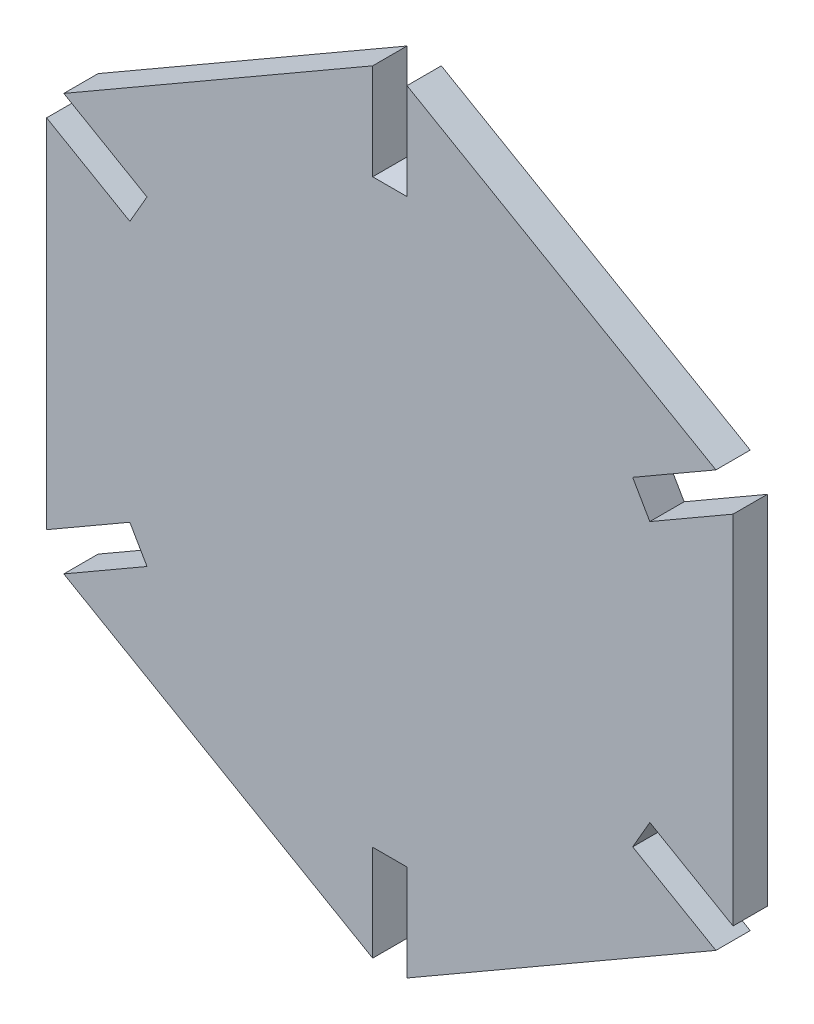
ISO-10303-21;
HEADER;
FILE_DESCRIPTION(('STEP AP214'),'2;1');
FILE_NAME('part.step','',(''),(''),'','','');
FILE_SCHEMA(('AUTOMOTIVE_DESIGN { 1 0 10303 214 1 1 1 1 }'));
ENDSEC;
DATA;
#1=APPLICATION_CONTEXT('core data for automotive mechanical design processes');
#2=APPLICATION_PROTOCOL_DEFINITION('international standard','automotive_design',2000,#1);
#3=PRODUCT_CONTEXT('',#1,'mechanical');
#4=PRODUCT('Part','Part','',(#3));
#5=PRODUCT_RELATED_PRODUCT_CATEGORY('part','',(#4));
#6=PRODUCT_DEFINITION_FORMATION('','',#4);
#7=PRODUCT_DEFINITION_CONTEXT('part definition',#1,'design');
#8=PRODUCT_DEFINITION('design','',#6,#7);
#9=PRODUCT_DEFINITION_SHAPE('','',#8);
#10=(LENGTH_UNIT() NAMED_UNIT(*) SI_UNIT(.MILLI.,.METRE.));
#11=(NAMED_UNIT(*) PLANE_ANGLE_UNIT() SI_UNIT($,.RADIAN.));
#12=(NAMED_UNIT(*) SI_UNIT($,.STERADIAN.) SOLID_ANGLE_UNIT());
#13=UNCERTAINTY_MEASURE_WITH_UNIT(LENGTH_MEASURE(1.E-05),#10,'distance_accuracy_value','');
#14=(GEOMETRIC_REPRESENTATION_CONTEXT(3) GLOBAL_UNCERTAINTY_ASSIGNED_CONTEXT((#13)) GLOBAL_UNIT_ASSIGNED_CONTEXT((#10,
#11,#12)) REPRESENTATION_CONTEXT('',''));
#15=CARTESIAN_POINT('',(0.,0.,0.));
#16=DIRECTION('',(0.,0.,1.));
#17=DIRECTION('',(1.,0.,0.));
#18=AXIS2_PLACEMENT_3D('',#15,#16,#17);
#19=CARTESIAN_POINT('',(0.,28.8675134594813,2.5));
#20=DIRECTION('',(0.5,-0.866025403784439,0.));
#21=DIRECTION('',(0.866025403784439,0.5,0.));
#22=AXIS2_PLACEMENT_3D('',#19,#20,#21);
#23=PLANE('',#22);
#24=DIRECTION('',(-0.866025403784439,-0.5,0.));
#25=VECTOR('',#24,1.);
#26=CARTESIAN_POINT('',(0.,28.8675134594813,0.));
#27=LINE('',#26,#25);
#28=CARTESIAN_POINT('',(-1.24999999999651,28.1458256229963,0.));
#29=VERTEX_POINT('',#28);
#30=CARTESIAN_POINT('',(-23.7499999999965,15.1554445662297,0.));
#31=VERTEX_POINT('',#30);
#32=EDGE_CURVE('E373',#29,#31,#27,.T.);
#33=ORIENTED_EDGE('',*,*,#32,.T.);
#34=DIRECTION('',(0.,0.,1.));
#35=VECTOR('',#34,1.);
#36=CARTESIAN_POINT('',(-23.7499999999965,15.1554445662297,0.));
#37=LINE('',#36,#35);
#38=CARTESIAN_POINT('',(-23.7499999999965,15.1554445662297,2.5));
#39=VERTEX_POINT('',#38);
#40=EDGE_CURVE('E329',#31,#39,#37,.T.);
#41=ORIENTED_EDGE('',*,*,#40,.T.);
#42=DIRECTION('',(-0.866025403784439,-0.5,0.));
#43=VECTOR('',#42,1.);
#44=CARTESIAN_POINT('',(0.,28.8675134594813,2.5));
#45=LINE('',#44,#43);
#46=CARTESIAN_POINT('',(-1.24999999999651,28.1458256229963,2.5));
#47=VERTEX_POINT('',#46);
#48=EDGE_CURVE('E361',#47,#39,#45,.T.);
#49=ORIENTED_EDGE('',*,*,#48,.F.);
#50=DIRECTION('',(0.,0.,1.));
#51=VECTOR('',#50,1.);
#52=CARTESIAN_POINT('',(-1.24999999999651,28.1458256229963,0.));
#53=LINE('',#52,#51);
#54=EDGE_CURVE('E353',#29,#47,#53,.T.);
#55=ORIENTED_EDGE('',*,*,#54,.F.);
#56=EDGE_LOOP('',(#33,#41,#49,#55));
#57=FACE_BOUND('',#56,.T.);
#58=ADVANCED_FACE('F33',(#57),#23,.F.);
#59=CARTESIAN_POINT('',(0.,0.,2.5));
#60=DIRECTION('',(0.,0.,1.));
#61=DIRECTION('',(1.,0.,0.));
#62=AXIS2_PLACEMENT_3D('',#59,#60,#61);
#63=PLANE('',#62);
#64=DIRECTION('',(-0.866025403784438,-0.5,0.));
#65=VECTOR('',#64,1.);
#66=CARTESIAN_POINT('',(17.6878221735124,11.6554445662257,2.5));
#67=LINE('',#66,#65);
#68=CARTESIAN_POINT('',(23.7500000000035,15.1554445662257,2.5));
#69=VERTEX_POINT('',#68);
#70=CARTESIAN_POINT('',(17.6878221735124,11.6554445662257,2.5));
#71=VERTEX_POINT('',#70);
#72=EDGE_CURVE('E202',#69,#71,#67,.T.);
#73=ORIENTED_EDGE('',*,*,#72,.F.);
#74=DIRECTION('',(-0.866025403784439,0.5,0.));
#75=VECTOR('',#74,1.);
#76=CARTESIAN_POINT('',(25.,14.4337567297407,2.5));
#77=LINE('',#76,#75);
#78=CARTESIAN_POINT('',(1.25000000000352,28.1458256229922,2.5));
#79=VERTEX_POINT('',#78);
#80=EDGE_CURVE('E359',#69,#79,#77,.T.);
#81=ORIENTED_EDGE('',*,*,#80,.T.);
#82=DIRECTION('',(0.,1.,0.));
#83=VECTOR('',#82,1.);
#84=CARTESIAN_POINT('',(1.25000000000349,21.1458256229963,2.5));
#85=LINE('',#84,#83);
#86=CARTESIAN_POINT('',(1.25000000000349,21.1458256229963,2.5));
#87=VERTEX_POINT('',#86);
#88=EDGE_CURVE('E346',#87,#79,#85,.T.);
#89=ORIENTED_EDGE('',*,*,#88,.F.);
#90=DIRECTION('',(1.,0.,0.));
#91=VECTOR('',#90,1.);
#92=CARTESIAN_POINT('',(-1.24999999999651,21.1458256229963,2.5));
#93=LINE('',#92,#91);
#94=CARTESIAN_POINT('',(-1.24999999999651,21.1458256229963,2.5));
#95=VERTEX_POINT('',#94);
#96=EDGE_CURVE('E231',#95,#87,#93,.T.);
#97=ORIENTED_EDGE('',*,*,#96,.F.);
#98=DIRECTION('',(0.,1.,0.));
#99=VECTOR('',#98,1.);
#100=CARTESIAN_POINT('',(-1.24999999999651,21.1458256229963,2.5));
#101=LINE('',#100,#99);
#102=EDGE_CURVE('E339',#95,#47,#101,.T.);
#103=ORIENTED_EDGE('',*,*,#102,.T.);
#104=ORIENTED_EDGE('',*,*,#48,.T.);
#105=DIRECTION('',(-0.866025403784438,0.500000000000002,0.));
#106=VECTOR('',#105,1.);
#107=CARTESIAN_POINT('',(-17.6878221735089,11.6554445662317,2.5));
#108=LINE('',#107,#106);
#109=CARTESIAN_POINT('',(-17.6878221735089,11.6554445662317,2.5));
#110=VERTEX_POINT('',#109);
#111=EDGE_CURVE('E314',#110,#39,#108,.T.);
#112=ORIENTED_EDGE('',*,*,#111,.F.);
#113=DIRECTION('',(0.499999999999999,0.866025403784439,0.));
#114=VECTOR('',#113,1.);
#115=CARTESIAN_POINT('',(-18.9378221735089,9.49038105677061,2.5));
#116=LINE('',#115,#114);
#117=CARTESIAN_POINT('',(-18.9378221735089,9.49038105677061,2.5));
#118=VERTEX_POINT('',#117);
#119=EDGE_CURVE('E324',#118,#110,#116,.T.);
#120=ORIENTED_EDGE('',*,*,#119,.F.);
#121=DIRECTION('',(0.866025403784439,-0.499999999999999,0.));
#122=VECTOR('',#121,1.);
#123=CARTESIAN_POINT('',(-18.9378221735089,9.49038105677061,2.5));
#124=LINE('',#123,#122);
#125=CARTESIAN_POINT('',(-25.,12.9903810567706,2.5));
#126=VERTEX_POINT('',#125);
#127=EDGE_CURVE('E321',#126,#118,#124,.T.);
#128=ORIENTED_EDGE('',*,*,#127,.F.);
#129=DIRECTION('',(0.,-1.,0.));
#130=VECTOR('',#129,1.);
#131=CARTESIAN_POINT('',(-25.,14.4337567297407,2.5));
#132=LINE('',#131,#130);
#133=CARTESIAN_POINT('',(-25.,-12.9903810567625,2.5));
#134=VERTEX_POINT('',#133);
#135=EDGE_CURVE('E364',#126,#134,#132,.T.);
#136=ORIENTED_EDGE('',*,*,#135,.T.);
#137=DIRECTION('',(-0.86602540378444,-0.499999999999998,0.));
#138=VECTOR('',#137,1.);
#139=CARTESIAN_POINT('',(-18.9378221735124,-9.49038105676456,2.5));
#140=LINE('',#139,#138);
#141=CARTESIAN_POINT('',(-18.9378221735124,-9.49038105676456,2.5));
#142=VERTEX_POINT('',#141);
#143=EDGE_CURVE('E290',#142,#134,#140,.T.);
#144=ORIENTED_EDGE('',*,*,#143,.F.);
#145=DIRECTION('',(-0.5,0.866025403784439,0.));
#146=VECTOR('',#145,1.);
#147=CARTESIAN_POINT('',(-17.6878221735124,-11.6554445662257,2.5));
#148=LINE('',#147,#146);
#149=CARTESIAN_POINT('',(-17.6878221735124,-11.6554445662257,2.5));
#150=VERTEX_POINT('',#149);
#151=EDGE_CURVE('E300',#150,#142,#148,.T.);
#152=ORIENTED_EDGE('',*,*,#151,.F.);
#153=DIRECTION('',(0.866025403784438,0.5,0.));
#154=VECTOR('',#153,1.);
#155=CARTESIAN_POINT('',(-17.6878221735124,-11.6554445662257,2.5));
#156=LINE('',#155,#154);
#157=CARTESIAN_POINT('',(-23.7500000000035,-15.1554445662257,2.5));
#158=VERTEX_POINT('',#157);
#159=EDGE_CURVE('E297',#158,#150,#156,.T.);
#160=ORIENTED_EDGE('',*,*,#159,.F.);
#161=DIRECTION('',(0.866025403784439,-0.5,0.));
#162=VECTOR('',#161,1.);
#163=CARTESIAN_POINT('',(-25.,-14.4337567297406,2.5));
#164=LINE('',#163,#162);
#165=CARTESIAN_POINT('',(-1.25000000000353,-28.1458256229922,2.5));
#166=VERTEX_POINT('',#165);
#167=EDGE_CURVE('E367',#158,#166,#164,.T.);
#168=ORIENTED_EDGE('',*,*,#167,.T.);
#169=DIRECTION('',(0.,-1.,0.));
#170=VECTOR('',#169,1.);
#171=CARTESIAN_POINT('',(-1.2500000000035,-21.1458256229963,2.5));
#172=LINE('',#171,#170);
#173=CARTESIAN_POINT('',(-1.2500000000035,-21.1458256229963,2.5));
#174=VERTEX_POINT('',#173);
#175=EDGE_CURVE('E266',#174,#166,#172,.T.);
#176=ORIENTED_EDGE('',*,*,#175,.F.);
#177=DIRECTION('',(-1.,0.,0.));
#178=VECTOR('',#177,1.);
#179=CARTESIAN_POINT('',(1.2499999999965,-21.1458256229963,2.5));
#180=LINE('',#179,#178);
#181=CARTESIAN_POINT('',(1.2499999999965,-21.1458256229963,2.5));
#182=VERTEX_POINT('',#181);
#183=EDGE_CURVE('E276',#182,#174,#180,.T.);
#184=ORIENTED_EDGE('',*,*,#183,.F.);
#185=DIRECTION('',(0.,1.,0.));
#186=VECTOR('',#185,1.);
#187=CARTESIAN_POINT('',(1.2499999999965,-21.1458256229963,2.5));
#188=LINE('',#187,#186);
#189=CARTESIAN_POINT('',(1.2499999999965,-28.1458256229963,2.5));
#190=VERTEX_POINT('',#189);
#191=EDGE_CURVE('E273',#190,#182,#188,.T.);
#192=ORIENTED_EDGE('',*,*,#191,.F.);
#193=DIRECTION('',(0.866025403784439,0.499999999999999,0.));
#194=VECTOR('',#193,1.);
#195=CARTESIAN_POINT('',(0.,-28.8675134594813,2.5));
#196=LINE('',#195,#194);
#197=CARTESIAN_POINT('',(23.7499999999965,-15.1554445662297,2.5));
#198=VERTEX_POINT('',#197);
#199=EDGE_CURVE('E42',#190,#198,#196,.T.);
#200=ORIENTED_EDGE('',*,*,#199,.T.);
#201=DIRECTION('',(0.866025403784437,-0.500000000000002,0.));
#202=VECTOR('',#201,1.);
#203=CARTESIAN_POINT('',(17.6878221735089,-11.6554445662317,2.5));
#204=LINE('',#203,#202);
#205=CARTESIAN_POINT('',(17.6878221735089,-11.6554445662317,2.5));
#206=VERTEX_POINT('',#205);
#207=EDGE_CURVE('E240',#206,#198,#204,.T.);
#208=ORIENTED_EDGE('',*,*,#207,.F.);
#209=DIRECTION('',(-0.5,-0.866025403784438,0.));
#210=VECTOR('',#209,1.);
#211=CARTESIAN_POINT('',(18.9378221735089,-9.4903810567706,2.5));
#212=LINE('',#211,#210);
#213=CARTESIAN_POINT('',(18.9378221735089,-9.4903810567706,2.5));
#214=VERTEX_POINT('',#213);
#215=EDGE_CURVE('E250',#214,#206,#212,.T.);
#216=ORIENTED_EDGE('',*,*,#215,.F.);
#217=DIRECTION('',(-0.866025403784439,0.499999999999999,0.));
#218=VECTOR('',#217,1.);
#219=CARTESIAN_POINT('',(18.9378221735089,-9.4903810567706,2.5));
#220=LINE('',#219,#218);
#221=CARTESIAN_POINT('',(25.,-12.9903810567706,2.5));
#222=VERTEX_POINT('',#221);
#223=EDGE_CURVE('E247',#222,#214,#220,.T.);
#224=ORIENTED_EDGE('',*,*,#223,.F.);
#225=DIRECTION('',(0.,1.,0.));
#226=VECTOR('',#225,1.);
#227=CARTESIAN_POINT('',(25.,-14.4337567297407,2.5));
#228=LINE('',#227,#226);
#229=CARTESIAN_POINT('',(25.,12.9903810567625,2.5));
#230=VERTEX_POINT('',#229);
#231=EDGE_CURVE('E11',#222,#230,#228,.T.);
#232=ORIENTED_EDGE('',*,*,#231,.T.);
#233=DIRECTION('',(0.86602540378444,0.499999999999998,0.));
#234=VECTOR('',#233,1.);
#235=CARTESIAN_POINT('',(18.9378221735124,9.49038105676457,2.5));
#236=LINE('',#235,#234);
#237=CARTESIAN_POINT('',(18.9378221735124,9.49038105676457,2.5));
#238=VERTEX_POINT('',#237);
#239=EDGE_CURVE('E220',#238,#230,#236,.T.);
#240=ORIENTED_EDGE('',*,*,#239,.F.);
#241=DIRECTION('',(0.500000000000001,-0.866025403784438,0.));
#242=VECTOR('',#241,1.);
#243=CARTESIAN_POINT('',(17.6878221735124,11.6554445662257,2.5));
#244=LINE('',#243,#242);
#245=EDGE_CURVE('E222',#71,#238,#244,.T.);
#246=ORIENTED_EDGE('',*,*,#245,.F.);
#247=EDGE_LOOP('',(#73,#81,#89,#97,#103,#104,#112,#120,#128,#136,#144,#152,#160,#168,#176,#184,
#192,#200,#208,#216,#224,#232,#240,#246));
#248=FACE_BOUND('',#247,.T.);
#249=ADVANCED_FACE('F396',(#248),#63,.T.);
#250=CARTESIAN_POINT('',(0.,0.,0.));
#251=DIRECTION('',(0.,0.,1.));
#252=DIRECTION('',(1.,0.,0.));
#253=AXIS2_PLACEMENT_3D('',#250,#251,#252);
#254=PLANE('',#253);
#255=DIRECTION('',(-0.866025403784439,0.5,0.));
#256=VECTOR('',#255,1.);
#257=CARTESIAN_POINT('',(25.,14.4337567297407,0.));
#258=LINE('',#257,#256);
#259=CARTESIAN_POINT('',(23.7500000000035,15.1554445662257,0.));
#260=VERTEX_POINT('',#259);
#261=CARTESIAN_POINT('',(1.25000000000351,28.1458256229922,0.));
#262=VERTEX_POINT('',#261);
#263=EDGE_CURVE('E219',#260,#262,#258,.T.);
#264=ORIENTED_EDGE('',*,*,#263,.F.);
#265=DIRECTION('',(-0.866025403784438,-0.5,0.));
#266=VECTOR('',#265,1.);
#267=CARTESIAN_POINT('',(17.6878221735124,11.6554445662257,0.));
#268=LINE('',#267,#266);
#269=CARTESIAN_POINT('',(17.6878221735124,11.6554445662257,0.));
#270=VERTEX_POINT('',#269);
#271=EDGE_CURVE('E199',#260,#270,#268,.T.);
#272=ORIENTED_EDGE('',*,*,#271,.T.);
#273=DIRECTION('',(0.500000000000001,-0.866025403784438,0.));
#274=VECTOR('',#273,1.);
#275=CARTESIAN_POINT('',(17.6878221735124,11.6554445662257,0.));
#276=LINE('',#275,#274);
#277=CARTESIAN_POINT('',(18.9378221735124,9.49038105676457,0.));
#278=VERTEX_POINT('',#277);
#279=EDGE_CURVE('E210',#270,#278,#276,.T.);
#280=ORIENTED_EDGE('',*,*,#279,.T.);
#281=DIRECTION('',(0.86602540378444,0.499999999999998,0.));
#282=VECTOR('',#281,1.);
#283=CARTESIAN_POINT('',(18.9378221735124,9.49038105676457,0.));
#284=LINE('',#283,#282);
#285=CARTESIAN_POINT('',(25.,12.9903810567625,0.));
#286=VERTEX_POINT('',#285);
#287=EDGE_CURVE('E207',#278,#286,#284,.T.);
#288=ORIENTED_EDGE('',*,*,#287,.T.);
#289=DIRECTION('',(0.,1.,0.));
#290=VECTOR('',#289,1.);
#291=CARTESIAN_POINT('',(25.,-14.4337567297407,0.));
#292=LINE('',#291,#290);
#293=CARTESIAN_POINT('',(25.,-12.9903810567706,0.));
#294=VERTEX_POINT('',#293);
#295=EDGE_CURVE('E37',#294,#286,#292,.T.);
#296=ORIENTED_EDGE('',*,*,#295,.F.);
#297=DIRECTION('',(-0.866025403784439,0.499999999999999,0.));
#298=VECTOR('',#297,1.);
#299=CARTESIAN_POINT('',(18.9378221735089,-9.4903810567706,0.));
#300=LINE('',#299,#298);
#301=CARTESIAN_POINT('',(18.9378221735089,-9.4903810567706,0.));
#302=VERTEX_POINT('',#301);
#303=EDGE_CURVE('E236',#294,#302,#300,.T.);
#304=ORIENTED_EDGE('',*,*,#303,.T.);
#305=DIRECTION('',(-0.5,-0.866025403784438,0.));
#306=VECTOR('',#305,1.);
#307=CARTESIAN_POINT('',(18.9378221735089,-9.4903810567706,0.));
#308=LINE('',#307,#306);
#309=CARTESIAN_POINT('',(17.6878221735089,-11.6554445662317,0.));
#310=VERTEX_POINT('',#309);
#311=EDGE_CURVE('E239',#302,#310,#308,.T.);
#312=ORIENTED_EDGE('',*,*,#311,.T.);
#313=DIRECTION('',(0.866025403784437,-0.500000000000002,0.));
#314=VECTOR('',#313,1.);
#315=CARTESIAN_POINT('',(17.6878221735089,-11.6554445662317,0.));
#316=LINE('',#315,#314);
#317=CARTESIAN_POINT('',(23.7499999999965,-15.1554445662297,0.));
#318=VERTEX_POINT('',#317);
#319=EDGE_CURVE('E243',#310,#318,#316,.T.);
#320=ORIENTED_EDGE('',*,*,#319,.T.);
#321=DIRECTION('',(0.866025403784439,0.499999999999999,0.));
#322=VECTOR('',#321,1.);
#323=CARTESIAN_POINT('',(0.,-28.8675134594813,0.));
#324=LINE('',#323,#322);
#325=CARTESIAN_POINT('',(1.2499999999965,-28.1458256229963,0.));
#326=VERTEX_POINT('',#325);
#327=EDGE_CURVE('E381',#326,#318,#324,.T.);
#328=ORIENTED_EDGE('',*,*,#327,.F.);
#329=DIRECTION('',(0.,1.,0.));
#330=VECTOR('',#329,1.);
#331=CARTESIAN_POINT('',(1.2499999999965,-21.1458256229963,0.));
#332=LINE('',#331,#330);
#333=CARTESIAN_POINT('',(1.2499999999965,-21.1458256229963,0.));
#334=VERTEX_POINT('',#333);
#335=EDGE_CURVE('E262',#326,#334,#332,.T.);
#336=ORIENTED_EDGE('',*,*,#335,.T.);
#337=DIRECTION('',(-1.,0.,0.));
#338=VECTOR('',#337,1.);
#339=CARTESIAN_POINT('',(1.2499999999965,-21.1458256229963,0.));
#340=LINE('',#339,#338);
#341=CARTESIAN_POINT('',(-1.2500000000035,-21.1458256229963,0.));
#342=VERTEX_POINT('',#341);
#343=EDGE_CURVE('E265',#334,#342,#340,.T.);
#344=ORIENTED_EDGE('',*,*,#343,.T.);
#345=DIRECTION('',(0.,-1.,0.));
#346=VECTOR('',#345,1.);
#347=CARTESIAN_POINT('',(-1.2500000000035,-21.1458256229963,0.));
#348=LINE('',#347,#346);
#349=CARTESIAN_POINT('',(-1.25000000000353,-28.1458256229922,0.));
#350=VERTEX_POINT('',#349);
#351=EDGE_CURVE('E269',#342,#350,#348,.T.);
#352=ORIENTED_EDGE('',*,*,#351,.T.);
#353=DIRECTION('',(0.866025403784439,-0.5,0.));
#354=VECTOR('',#353,1.);
#355=CARTESIAN_POINT('',(-25.,-14.4337567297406,0.));
#356=LINE('',#355,#354);
#357=CARTESIAN_POINT('',(-23.7500000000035,-15.1554445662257,0.));
#358=VERTEX_POINT('',#357);
#359=EDGE_CURVE('E379',#358,#350,#356,.T.);
#360=ORIENTED_EDGE('',*,*,#359,.F.);
#361=DIRECTION('',(0.866025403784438,0.5,0.));
#362=VECTOR('',#361,1.);
#363=CARTESIAN_POINT('',(-17.6878221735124,-11.6554445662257,0.));
#364=LINE('',#363,#362);
#365=CARTESIAN_POINT('',(-17.6878221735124,-11.6554445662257,0.));
#366=VERTEX_POINT('',#365);
#367=EDGE_CURVE('E58',#358,#366,#364,.T.);
#368=ORIENTED_EDGE('',*,*,#367,.T.);
#369=DIRECTION('',(-0.5,0.866025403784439,0.));
#370=VECTOR('',#369,1.);
#371=CARTESIAN_POINT('',(-17.6878221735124,-11.6554445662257,0.));
#372=LINE('',#371,#370);
#373=CARTESIAN_POINT('',(-18.9378221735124,-9.49038105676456,0.));
#374=VERTEX_POINT('',#373);
#375=EDGE_CURVE('E289',#366,#374,#372,.T.);
#376=ORIENTED_EDGE('',*,*,#375,.T.);
#377=DIRECTION('',(-0.86602540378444,-0.499999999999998,0.));
#378=VECTOR('',#377,1.);
#379=CARTESIAN_POINT('',(-18.9378221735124,-9.49038105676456,0.));
#380=LINE('',#379,#378);
#381=CARTESIAN_POINT('',(-25.,-12.9903810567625,0.));
#382=VERTEX_POINT('',#381);
#383=EDGE_CURVE('E293',#374,#382,#380,.T.);
#384=ORIENTED_EDGE('',*,*,#383,.T.);
#385=DIRECTION('',(0.,-1.,0.));
#386=VECTOR('',#385,1.);
#387=CARTESIAN_POINT('',(-25.,14.4337567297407,0.));
#388=LINE('',#387,#386);
#389=CARTESIAN_POINT('',(-25.,12.9903810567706,0.));
#390=VERTEX_POINT('',#389);
#391=EDGE_CURVE('E376',#390,#382,#388,.T.);
#392=ORIENTED_EDGE('',*,*,#391,.F.);
#393=DIRECTION('',(0.866025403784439,-0.499999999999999,0.));
#394=VECTOR('',#393,1.);
#395=CARTESIAN_POINT('',(-18.9378221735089,9.49038105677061,0.));
#396=LINE('',#395,#394);
#397=CARTESIAN_POINT('',(-18.9378221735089,9.49038105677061,0.));
#398=VERTEX_POINT('',#397);
#399=EDGE_CURVE('E50',#390,#398,#396,.T.);
#400=ORIENTED_EDGE('',*,*,#399,.T.);
#401=DIRECTION('',(0.499999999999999,0.866025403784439,0.));
#402=VECTOR('',#401,1.);
#403=CARTESIAN_POINT('',(-18.9378221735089,9.49038105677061,0.));
#404=LINE('',#403,#402);
#405=CARTESIAN_POINT('',(-17.6878221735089,11.6554445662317,0.));
#406=VERTEX_POINT('',#405);
#407=EDGE_CURVE('E313',#398,#406,#404,.T.);
#408=ORIENTED_EDGE('',*,*,#407,.T.);
#409=DIRECTION('',(-0.866025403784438,0.500000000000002,0.));
#410=VECTOR('',#409,1.);
#411=CARTESIAN_POINT('',(-17.6878221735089,11.6554445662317,0.));
#412=LINE('',#411,#410);
#413=EDGE_CURVE('E317',#406,#31,#412,.T.);
#414=ORIENTED_EDGE('',*,*,#413,.T.);
#415=ORIENTED_EDGE('',*,*,#32,.F.);
#416=DIRECTION('',(0.,1.,0.));
#417=VECTOR('',#416,1.);
#418=CARTESIAN_POINT('',(-1.24999999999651,21.1458256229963,0.));
#419=LINE('',#418,#417);
#420=CARTESIAN_POINT('',(-1.24999999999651,21.1458256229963,0.));
#421=VERTEX_POINT('',#420);
#422=EDGE_CURVE('E341',#421,#29,#419,.T.);
#423=ORIENTED_EDGE('',*,*,#422,.F.);
#424=DIRECTION('',(1.,0.,0.));
#425=VECTOR('',#424,1.);
#426=CARTESIAN_POINT('',(-1.24999999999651,21.1458256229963,0.));
#427=LINE('',#426,#425);
#428=CARTESIAN_POINT('',(1.25000000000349,21.1458256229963,0.));
#429=VERTEX_POINT('',#428);
#430=EDGE_CURVE('E335',#421,#429,#427,.T.);
#431=ORIENTED_EDGE('',*,*,#430,.T.);
#432=DIRECTION('',(0.,1.,0.));
#433=VECTOR('',#432,1.);
#434=CARTESIAN_POINT('',(1.25000000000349,21.1458256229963,0.));
#435=LINE('',#434,#433);
#436=EDGE_CURVE('E338',#429,#262,#435,.T.);
#437=ORIENTED_EDGE('',*,*,#436,.T.);
#438=EDGE_LOOP('',(#264,#272,#280,#288,#296,#304,#312,#320,#328,#336,#344,#352,#360,#368,#376,
#384,#392,#400,#408,#414,#415,#423,#431,#437));
#439=FACE_BOUND('',#438,.T.);
#440=ADVANCED_FACE('F217',(#439),#254,.F.);
#441=CARTESIAN_POINT('',(25.,14.4337567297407,2.5));
#442=DIRECTION('',(-0.5,-0.866025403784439,0.));
#443=DIRECTION('',(0.866025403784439,-0.5,0.));
#444=AXIS2_PLACEMENT_3D('',#441,#442,#443);
#445=PLANE('',#444);
#446=ORIENTED_EDGE('',*,*,#80,.F.);
#447=DIRECTION('',(0.,0.,1.));
#448=VECTOR('',#447,1.);
#449=CARTESIAN_POINT('',(23.7500000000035,15.1554445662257,0.));
#450=LINE('',#449,#448);
#451=EDGE_CURVE('E229',#260,#69,#450,.T.);
#452=ORIENTED_EDGE('',*,*,#451,.F.);
#453=ORIENTED_EDGE('',*,*,#263,.T.);
#454=DIRECTION('',(0.,0.,1.));
#455=VECTOR('',#454,1.);
#456=CARTESIAN_POINT('',(1.25000000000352,28.1458256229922,0.));
#457=LINE('',#456,#455);
#458=EDGE_CURVE('E355',#262,#79,#457,.T.);
#459=ORIENTED_EDGE('',*,*,#458,.T.);
#460=EDGE_LOOP('',(#446,#452,#453,#459));
#461=FACE_BOUND('',#460,.T.);
#462=ADVANCED_FACE('F35',(#461),#445,.F.);
#463=CARTESIAN_POINT('',(-25.,14.4337567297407,2.5));
#464=DIRECTION('',(1.,0.,0.));
#465=DIRECTION('',(0.,1.,0.));
#466=AXIS2_PLACEMENT_3D('',#463,#464,#465);
#467=PLANE('',#466);
#468=ORIENTED_EDGE('',*,*,#391,.T.);
#469=DIRECTION('',(0.,0.,1.));
#470=VECTOR('',#469,1.);
#471=CARTESIAN_POINT('',(-25.,-12.9903810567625,0.));
#472=LINE('',#471,#470);
#473=EDGE_CURVE('E306',#382,#134,#472,.T.);
#474=ORIENTED_EDGE('',*,*,#473,.T.);
#475=ORIENTED_EDGE('',*,*,#135,.F.);
#476=DIRECTION('',(0.,0.,1.));
#477=VECTOR('',#476,1.);
#478=CARTESIAN_POINT('',(-25.,12.9903810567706,0.));
#479=LINE('',#478,#477);
#480=EDGE_CURVE('E301',#390,#126,#479,.T.);
#481=ORIENTED_EDGE('',*,*,#480,.F.);
#482=EDGE_LOOP('',(#468,#474,#475,#481));
#483=FACE_BOUND('',#482,.T.);
#484=ADVANCED_FACE('F438',(#483),#467,.F.);
#485=CARTESIAN_POINT('',(-25.,-14.4337567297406,2.5));
#486=DIRECTION('',(0.5,0.866025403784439,0.));
#487=DIRECTION('',(-0.866025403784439,0.5,0.));
#488=AXIS2_PLACEMENT_3D('',#485,#486,#487);
#489=PLANE('',#488);
#490=ORIENTED_EDGE('',*,*,#359,.T.);
#491=DIRECTION('',(0.,0.,1.));
#492=VECTOR('',#491,1.);
#493=CARTESIAN_POINT('',(-1.25000000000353,-28.1458256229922,0.));
#494=LINE('',#493,#492);
#495=EDGE_CURVE('E282',#350,#166,#494,.T.);
#496=ORIENTED_EDGE('',*,*,#495,.T.);
#497=ORIENTED_EDGE('',*,*,#167,.F.);
#498=DIRECTION('',(0.,0.,1.));
#499=VECTOR('',#498,1.);
#500=CARTESIAN_POINT('',(-23.7500000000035,-15.1554445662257,0.));
#501=LINE('',#500,#499);
#502=EDGE_CURVE('E277',#358,#158,#501,.T.);
#503=ORIENTED_EDGE('',*,*,#502,.F.);
#504=EDGE_LOOP('',(#490,#496,#497,#503));
#505=FACE_BOUND('',#504,.T.);
#506=ADVANCED_FACE('F424',(#505),#489,.F.);
#507=CARTESIAN_POINT('',(0.,-28.8675134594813,2.5));
#508=DIRECTION('',(-0.499999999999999,0.866025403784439,0.));
#509=DIRECTION('',(-0.866025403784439,-0.499999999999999,0.));
#510=AXIS2_PLACEMENT_3D('',#507,#508,#509);
#511=PLANE('',#510);
#512=ORIENTED_EDGE('',*,*,#327,.T.);
#513=DIRECTION('',(0.,0.,1.));
#514=VECTOR('',#513,1.);
#515=CARTESIAN_POINT('',(23.7499999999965,-15.1554445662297,0.));
#516=LINE('',#515,#514);
#517=EDGE_CURVE('E256',#318,#198,#516,.T.);
#518=ORIENTED_EDGE('',*,*,#517,.T.);
#519=ORIENTED_EDGE('',*,*,#199,.F.);
#520=DIRECTION('',(0.,0.,1.));
#521=VECTOR('',#520,1.);
#522=CARTESIAN_POINT('',(1.2499999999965,-28.1458256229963,0.));
#523=LINE('',#522,#521);
#524=EDGE_CURVE('E251',#326,#190,#523,.T.);
#525=ORIENTED_EDGE('',*,*,#524,.F.);
#526=EDGE_LOOP('',(#512,#518,#519,#525));
#527=FACE_BOUND('',#526,.T.);
#528=ADVANCED_FACE('F409',(#527),#511,.F.);
#529=CARTESIAN_POINT('',(25.,-14.4337567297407,2.5));
#530=DIRECTION('',(-1.,0.,0.));
#531=DIRECTION('',(0.,-1.,0.));
#532=AXIS2_PLACEMENT_3D('',#529,#530,#531);
#533=PLANE('',#532);
#534=ORIENTED_EDGE('',*,*,#295,.T.);
#535=DIRECTION('',(0.,0.,1.));
#536=VECTOR('',#535,1.);
#537=CARTESIAN_POINT('',(25.,12.9903810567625,0.));
#538=LINE('',#537,#536);
#539=EDGE_CURVE('E232',#286,#230,#538,.T.);
#540=ORIENTED_EDGE('',*,*,#539,.T.);
#541=ORIENTED_EDGE('',*,*,#231,.F.);
#542=DIRECTION('',(0.,0.,1.));
#543=VECTOR('',#542,1.);
#544=CARTESIAN_POINT('',(25.,-12.9903810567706,0.));
#545=LINE('',#544,#543);
#546=EDGE_CURVE('E227',#294,#222,#545,.T.);
#547=ORIENTED_EDGE('',*,*,#546,.F.);
#548=EDGE_LOOP('',(#534,#540,#541,#547));
#549=FACE_BOUND('',#548,.T.);
#550=ADVANCED_FACE('F390',(#549),#533,.F.);
#551=CARTESIAN_POINT('',(-1.24999999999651,21.1458256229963,0.));
#552=DIRECTION('',(0.,-1.,0.));
#553=DIRECTION('',(0.,0.,-1.));
#554=AXIS2_PLACEMENT_3D('',#551,#552,#553);
#555=PLANE('',#554);
#556=ORIENTED_EDGE('',*,*,#96,.T.);
#557=DIRECTION('',(0.,0.,1.));
#558=VECTOR('',#557,1.);
#559=CARTESIAN_POINT('',(1.25000000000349,21.1458256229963,0.));
#560=LINE('',#559,#558);
#561=EDGE_CURVE('E343',#429,#87,#560,.T.);
#562=ORIENTED_EDGE('',*,*,#561,.F.);
#563=ORIENTED_EDGE('',*,*,#430,.F.);
#564=DIRECTION('',(0.,0.,1.));
#565=VECTOR('',#564,1.);
#566=CARTESIAN_POINT('',(-1.24999999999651,21.1458256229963,0.));
#567=LINE('',#566,#565);
#568=EDGE_CURVE('E351',#421,#95,#567,.T.);
#569=ORIENTED_EDGE('',*,*,#568,.T.);
#570=EDGE_LOOP('',(#556,#562,#563,#569));
#571=FACE_BOUND('',#570,.T.);
#572=ADVANCED_FACE('F462',(#571),#555,.F.);
#573=CARTESIAN_POINT('',(-1.24999999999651,21.1458256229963,0.));
#574=DIRECTION('',(1.,0.,0.));
#575=DIRECTION('',(0.,1.,0.));
#576=AXIS2_PLACEMENT_3D('',#573,#574,#575);
#577=PLANE('',#576);
#578=ORIENTED_EDGE('',*,*,#102,.F.);
#579=ORIENTED_EDGE('',*,*,#568,.F.);
#580=ORIENTED_EDGE('',*,*,#422,.T.);
#581=ORIENTED_EDGE('',*,*,#54,.T.);
#582=EDGE_LOOP('',(#578,#579,#580,#581));
#583=FACE_BOUND('',#582,.T.);
#584=ADVANCED_FACE('F457',(#583),#577,.T.);
#585=CARTESIAN_POINT('',(1.25000000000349,21.1458256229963,0.));
#586=DIRECTION('',(1.,0.,0.));
#587=DIRECTION('',(0.,1.,0.));
#588=AXIS2_PLACEMENT_3D('',#585,#586,#587);
#589=PLANE('',#588);
#590=ORIENTED_EDGE('',*,*,#88,.T.);
#591=ORIENTED_EDGE('',*,*,#458,.F.);
#592=ORIENTED_EDGE('',*,*,#436,.F.);
#593=ORIENTED_EDGE('',*,*,#561,.T.);
#594=EDGE_LOOP('',(#590,#591,#592,#593));
#595=FACE_BOUND('',#594,.T.);
#596=ADVANCED_FACE('F465',(#595),#589,.F.);
#597=CARTESIAN_POINT('',(18.9378221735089,-9.4903810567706,0.));
#598=DIRECTION('',(0.5,0.866025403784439,0.));
#599=DIRECTION('',(-0.866025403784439,0.5,0.));
#600=AXIS2_PLACEMENT_3D('',#597,#598,#599);
#601=PLANE('',#600);
#602=ORIENTED_EDGE('',*,*,#223,.T.);
#603=DIRECTION('',(0.,0.,1.));
#604=VECTOR('',#603,1.);
#605=CARTESIAN_POINT('',(18.9378221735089,-9.4903810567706,0.));
#606=LINE('',#605,#604);
#607=EDGE_CURVE('E246',#302,#214,#606,.T.);
#608=ORIENTED_EDGE('',*,*,#607,.F.);
#609=ORIENTED_EDGE('',*,*,#303,.F.);
#610=ORIENTED_EDGE('',*,*,#546,.T.);
#611=EDGE_LOOP('',(#602,#608,#609,#610));
#612=FACE_BOUND('',#611,.T.);
#613=ADVANCED_FACE('F401',(#612),#601,.F.);
#614=CARTESIAN_POINT('',(17.6878221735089,-11.6554445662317,0.));
#615=DIRECTION('',(-0.500000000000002,-0.866025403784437,0.));
#616=DIRECTION('',(0.866025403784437,-0.500000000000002,0.));
#617=AXIS2_PLACEMENT_3D('',#614,#615,#616);
#618=PLANE('',#617);
#619=ORIENTED_EDGE('',*,*,#207,.T.);
#620=ORIENTED_EDGE('',*,*,#517,.F.);
#621=ORIENTED_EDGE('',*,*,#319,.F.);
#622=DIRECTION('',(0.,0.,1.));
#623=VECTOR('',#622,1.);
#624=CARTESIAN_POINT('',(17.6878221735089,-11.6554445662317,0.));
#625=LINE('',#624,#623);
#626=EDGE_CURVE('E259',#310,#206,#625,.T.);
#627=ORIENTED_EDGE('',*,*,#626,.T.);
#628=EDGE_LOOP('',(#619,#620,#621,#627));
#629=FACE_BOUND('',#628,.T.);
#630=ADVANCED_FACE('F407',(#629),#618,.F.);
#631=CARTESIAN_POINT('',(18.9378221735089,-9.4903810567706,0.));
#632=DIRECTION('',(-0.866025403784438,0.5,0.));
#633=DIRECTION('',(-0.5,-0.866025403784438,0.));
#634=AXIS2_PLACEMENT_3D('',#631,#632,#633);
#635=PLANE('',#634);
#636=ORIENTED_EDGE('',*,*,#215,.T.);
#637=ORIENTED_EDGE('',*,*,#626,.F.);
#638=ORIENTED_EDGE('',*,*,#311,.F.);
#639=ORIENTED_EDGE('',*,*,#607,.T.);
#640=EDGE_LOOP('',(#636,#637,#638,#639));
#641=FACE_BOUND('',#640,.T.);
#642=ADVANCED_FACE('F404',(#641),#635,.F.);
#643=CARTESIAN_POINT('',(17.6878221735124,11.6554445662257,0.));
#644=DIRECTION('',(-0.5,0.866025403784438,0.));
#645=DIRECTION('',(-0.866025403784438,-0.5,0.));
#646=AXIS2_PLACEMENT_3D('',#643,#644,#645);
#647=PLANE('',#646);
#648=ORIENTED_EDGE('',*,*,#72,.T.);
#649=DIRECTION('',(0.,0.,1.));
#650=VECTOR('',#649,1.);
#651=CARTESIAN_POINT('',(17.6878221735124,11.6554445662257,0.));
#652=LINE('',#651,#650);
#653=EDGE_CURVE('E195',#270,#71,#652,.T.);
#654=ORIENTED_EDGE('',*,*,#653,.F.);
#655=ORIENTED_EDGE('',*,*,#271,.F.);
#656=ORIENTED_EDGE('',*,*,#451,.T.);
#657=EDGE_LOOP('',(#648,#654,#655,#656));
#658=FACE_BOUND('',#657,.T.);
#659=ADVANCED_FACE('F197',(#658),#647,.F.);
#660=CARTESIAN_POINT('',(18.9378221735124,9.49038105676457,0.));
#661=DIRECTION('',(0.499999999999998,-0.86602540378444,0.));
#662=DIRECTION('',(0.86602540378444,0.499999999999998,0.));
#663=AXIS2_PLACEMENT_3D('',#660,#661,#662);
#664=PLANE('',#663);
#665=ORIENTED_EDGE('',*,*,#239,.T.);
#666=ORIENTED_EDGE('',*,*,#539,.F.);
#667=ORIENTED_EDGE('',*,*,#287,.F.);
#668=DIRECTION('',(0.,0.,1.));
#669=VECTOR('',#668,1.);
#670=CARTESIAN_POINT('',(18.9378221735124,9.49038105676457,0.));
#671=LINE('',#670,#669);
#672=EDGE_CURVE('E206',#278,#238,#671,.T.);
#673=ORIENTED_EDGE('',*,*,#672,.T.);
#674=EDGE_LOOP('',(#665,#666,#667,#673));
#675=FACE_BOUND('',#674,.T.);
#676=ADVANCED_FACE('F393',(#675),#664,.F.);
#677=CARTESIAN_POINT('',(17.6878221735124,11.6554445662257,0.));
#678=DIRECTION('',(-0.866025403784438,-0.500000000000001,0.));
#679=DIRECTION('',(0.500000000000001,-0.866025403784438,0.));
#680=AXIS2_PLACEMENT_3D('',#677,#678,#679);
#681=PLANE('',#680);
#682=ORIENTED_EDGE('',*,*,#245,.T.);
#683=ORIENTED_EDGE('',*,*,#672,.F.);
#684=ORIENTED_EDGE('',*,*,#279,.F.);
#685=ORIENTED_EDGE('',*,*,#653,.T.);
#686=EDGE_LOOP('',(#682,#683,#684,#685));
#687=FACE_BOUND('',#686,.T.);
#688=ADVANCED_FACE('F211',(#687),#681,.F.);
#689=CARTESIAN_POINT('',(1.2499999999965,-21.1458256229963,0.));
#690=DIRECTION('',(1.,0.,0.));
#691=DIRECTION('',(0.,1.,0.));
#692=AXIS2_PLACEMENT_3D('',#689,#690,#691);
#693=PLANE('',#692);
#694=ORIENTED_EDGE('',*,*,#191,.T.);
#695=DIRECTION('',(0.,0.,1.));
#696=VECTOR('',#695,1.);
#697=CARTESIAN_POINT('',(1.2499999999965,-21.1458256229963,0.));
#698=LINE('',#697,#696);
#699=EDGE_CURVE('E272',#334,#182,#698,.T.);
#700=ORIENTED_EDGE('',*,*,#699,.F.);
#701=ORIENTED_EDGE('',*,*,#335,.F.);
#702=ORIENTED_EDGE('',*,*,#524,.T.);
#703=EDGE_LOOP('',(#694,#700,#701,#702));
#704=FACE_BOUND('',#703,.T.);
#705=ADVANCED_FACE('F414',(#704),#693,.F.);
#706=CARTESIAN_POINT('',(-1.2500000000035,-21.1458256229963,0.));
#707=DIRECTION('',(-1.,0.,0.));
#708=DIRECTION('',(0.,-1.,0.));
#709=AXIS2_PLACEMENT_3D('',#706,#707,#708);
#710=PLANE('',#709);
#711=ORIENTED_EDGE('',*,*,#175,.T.);
#712=ORIENTED_EDGE('',*,*,#495,.F.);
#713=ORIENTED_EDGE('',*,*,#351,.F.);
#714=DIRECTION('',(0.,0.,1.));
#715=VECTOR('',#714,1.);
#716=CARTESIAN_POINT('',(-1.2500000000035,-21.1458256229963,0.));
#717=LINE('',#716,#715);
#718=EDGE_CURVE('E285',#342,#174,#717,.T.);
#719=ORIENTED_EDGE('',*,*,#718,.T.);
#720=EDGE_LOOP('',(#711,#712,#713,#719));
#721=FACE_BOUND('',#720,.T.);
#722=ADVANCED_FACE('F421',(#721),#710,.F.);
#723=CARTESIAN_POINT('',(1.2499999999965,-21.1458256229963,0.));
#724=DIRECTION('',(0.,1.,0.));
#725=DIRECTION('',(-1.,0.,0.));
#726=AXIS2_PLACEMENT_3D('',#723,#724,#725);
#727=PLANE('',#726);
#728=ORIENTED_EDGE('',*,*,#183,.T.);
#729=ORIENTED_EDGE('',*,*,#718,.F.);
#730=ORIENTED_EDGE('',*,*,#343,.F.);
#731=ORIENTED_EDGE('',*,*,#699,.T.);
#732=EDGE_LOOP('',(#728,#729,#730,#731));
#733=FACE_BOUND('',#732,.T.);
#734=ADVANCED_FACE('F419',(#733),#727,.F.);
#735=CARTESIAN_POINT('',(-17.6878221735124,-11.6554445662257,0.));
#736=DIRECTION('',(0.5,-0.866025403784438,0.));
#737=DIRECTION('',(0.866025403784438,0.5,0.));
#738=AXIS2_PLACEMENT_3D('',#735,#736,#737);
#739=PLANE('',#738);
#740=ORIENTED_EDGE('',*,*,#159,.T.);
#741=DIRECTION('',(0.,0.,1.));
#742=VECTOR('',#741,1.);
#743=CARTESIAN_POINT('',(-17.6878221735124,-11.6554445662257,0.));
#744=LINE('',#743,#742);
#745=EDGE_CURVE('E296',#366,#150,#744,.T.);
#746=ORIENTED_EDGE('',*,*,#745,.F.);
#747=ORIENTED_EDGE('',*,*,#367,.F.);
#748=ORIENTED_EDGE('',*,*,#502,.T.);
#749=EDGE_LOOP('',(#740,#746,#747,#748));
#750=FACE_BOUND('',#749,.T.);
#751=ADVANCED_FACE('F428',(#750),#739,.F.);
#752=CARTESIAN_POINT('',(-18.9378221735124,-9.49038105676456,0.));
#753=DIRECTION('',(-0.499999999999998,0.86602540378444,0.));
#754=DIRECTION('',(-0.86602540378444,-0.499999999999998,0.));
#755=AXIS2_PLACEMENT_3D('',#752,#753,#754);
#756=PLANE('',#755);
#757=ORIENTED_EDGE('',*,*,#143,.T.);
#758=ORIENTED_EDGE('',*,*,#473,.F.);
#759=ORIENTED_EDGE('',*,*,#383,.F.);
#760=DIRECTION('',(0.,0.,1.));
#761=VECTOR('',#760,1.);
#762=CARTESIAN_POINT('',(-18.9378221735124,-9.49038105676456,0.));
#763=LINE('',#762,#761);
#764=EDGE_CURVE('E309',#374,#142,#763,.T.);
#765=ORIENTED_EDGE('',*,*,#764,.T.);
#766=EDGE_LOOP('',(#757,#758,#759,#765));
#767=FACE_BOUND('',#766,.T.);
#768=ADVANCED_FACE('F435',(#767),#756,.F.);
#769=CARTESIAN_POINT('',(-17.6878221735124,-11.6554445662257,0.));
#770=DIRECTION('',(0.866025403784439,0.5,0.));
#771=DIRECTION('',(-0.5,0.866025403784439,0.));
#772=AXIS2_PLACEMENT_3D('',#769,#770,#771);
#773=PLANE('',#772);
#774=ORIENTED_EDGE('',*,*,#151,.T.);
#775=ORIENTED_EDGE('',*,*,#764,.F.);
#776=ORIENTED_EDGE('',*,*,#375,.F.);
#777=ORIENTED_EDGE('',*,*,#745,.T.);
#778=EDGE_LOOP('',(#774,#775,#776,#777));
#779=FACE_BOUND('',#778,.T.);
#780=ADVANCED_FACE('F433',(#779),#773,.F.);
#781=CARTESIAN_POINT('',(-18.9378221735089,9.49038105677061,0.));
#782=DIRECTION('',(-0.499999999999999,-0.866025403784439,0.));
#783=DIRECTION('',(0.866025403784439,-0.499999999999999,0.));
#784=AXIS2_PLACEMENT_3D('',#781,#782,#783);
#785=PLANE('',#784);
#786=ORIENTED_EDGE('',*,*,#127,.T.);
#787=DIRECTION('',(0.,0.,1.));
#788=VECTOR('',#787,1.);
#789=CARTESIAN_POINT('',(-18.9378221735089,9.49038105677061,0.));
#790=LINE('',#789,#788);
#791=EDGE_CURVE('E320',#398,#118,#790,.T.);
#792=ORIENTED_EDGE('',*,*,#791,.F.);
#793=ORIENTED_EDGE('',*,*,#399,.F.);
#794=ORIENTED_EDGE('',*,*,#480,.T.);
#795=EDGE_LOOP('',(#786,#792,#793,#794));
#796=FACE_BOUND('',#795,.T.);
#797=ADVANCED_FACE('F442',(#796),#785,.F.);
#798=CARTESIAN_POINT('',(-17.6878221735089,11.6554445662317,0.));
#799=DIRECTION('',(0.500000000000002,0.866025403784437,0.));
#800=DIRECTION('',(-0.866025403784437,0.500000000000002,0.));
#801=AXIS2_PLACEMENT_3D('',#798,#799,#800);
#802=PLANE('',#801);
#803=ORIENTED_EDGE('',*,*,#111,.T.);
#804=ORIENTED_EDGE('',*,*,#40,.F.);
#805=ORIENTED_EDGE('',*,*,#413,.F.);
#806=DIRECTION('',(0.,0.,1.));
#807=VECTOR('',#806,1.);
#808=CARTESIAN_POINT('',(-17.6878221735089,11.6554445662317,0.));
#809=LINE('',#808,#807);
#810=EDGE_CURVE('E332',#406,#110,#809,.T.);
#811=ORIENTED_EDGE('',*,*,#810,.T.);
#812=EDGE_LOOP('',(#803,#804,#805,#811));
#813=FACE_BOUND('',#812,.T.);
#814=ADVANCED_FACE('F449',(#813),#802,.F.);
#815=CARTESIAN_POINT('',(-18.9378221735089,9.49038105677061,0.));
#816=DIRECTION('',(0.866025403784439,-0.499999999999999,0.));
#817=DIRECTION('',(0.499999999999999,0.866025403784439,0.));
#818=AXIS2_PLACEMENT_3D('',#815,#816,#817);
#819=PLANE('',#818);
#820=ORIENTED_EDGE('',*,*,#119,.T.);
#821=ORIENTED_EDGE('',*,*,#810,.F.);
#822=ORIENTED_EDGE('',*,*,#407,.F.);
#823=ORIENTED_EDGE('',*,*,#791,.T.);
#824=EDGE_LOOP('',(#820,#821,#822,#823));
#825=FACE_BOUND('',#824,.T.);
#826=ADVANCED_FACE('F447',(#825),#819,.F.);
#827=CLOSED_SHELL('',(#58,#249,#440,#462,#484,#506,#528,#550,#572,#584,#596,#613,#630,#642,#659,
#676,#688,#705,#722,#734,#751,#768,#780,#797,#814,#826));
#828=MANIFOLD_SOLID_BREP('B2',#827);
#829=ADVANCED_BREP_SHAPE_REPRESENTATION('',(#18,#828),#14);
#830=SHAPE_DEFINITION_REPRESENTATION(#9,#829);
ENDSEC;
END-ISO-10303-21;
